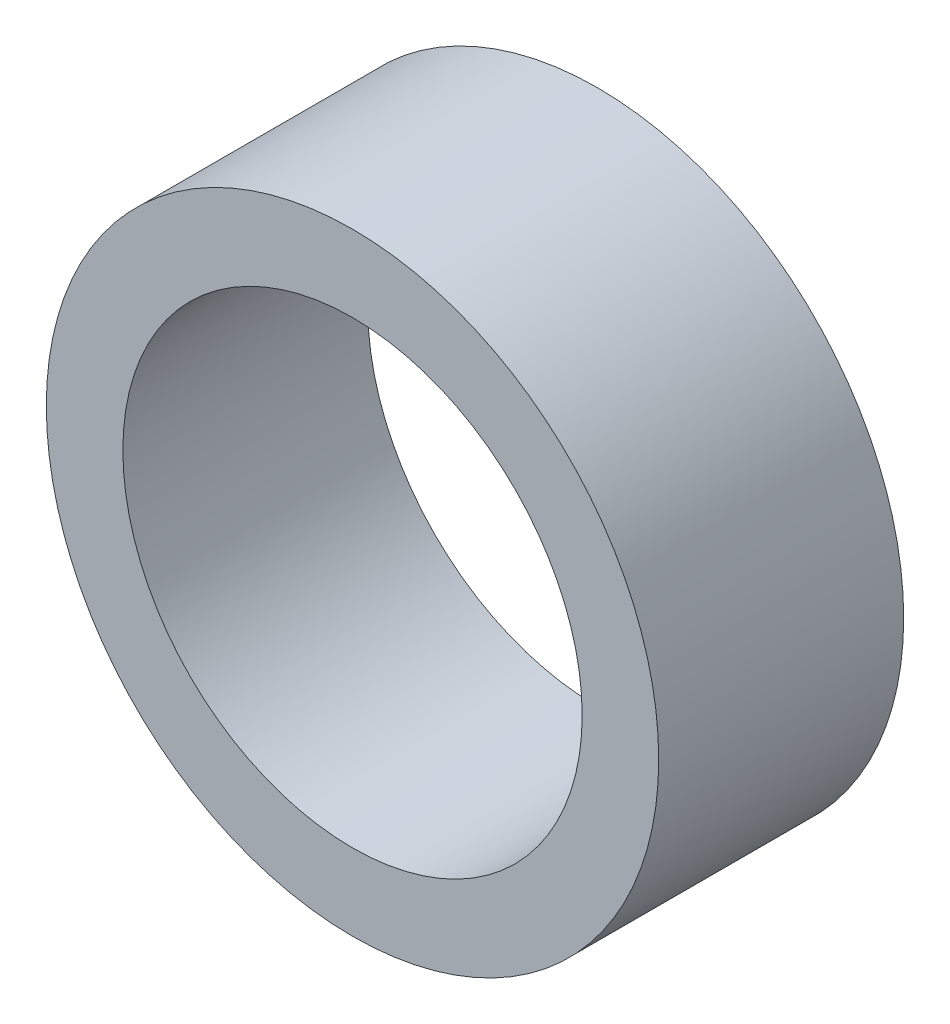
from build123d import *

# Parameters (mm, degrees)
SKETCH1_R          = 3.175
SKETCH1_R_2        = 2.38125
EXTRUDE1_DEPTH     = 6.35
SKETCH2_R          = 3.175
CUT_EXTRUDE1_DEPTH = 3.81


with BuildPart() as part:
    # Sketch1 → Extrude1 (new body)
    with BuildSketch(Plane.XY):
        Circle(SKETCH1_R)
        Circle(SKETCH1_R_2, mode=Mode.SUBTRACT)
    extrude(amount=EXTRUDE1_DEPTH)

    # Sketch2 → Cut-Extrude1 (cut)
    with BuildSketch(Plane.XY):
        Circle(SKETCH2_R)
    extrude(amount=CUT_EXTRUDE1_DEPTH, mode=Mode.SUBTRACT)


solid = part.part
